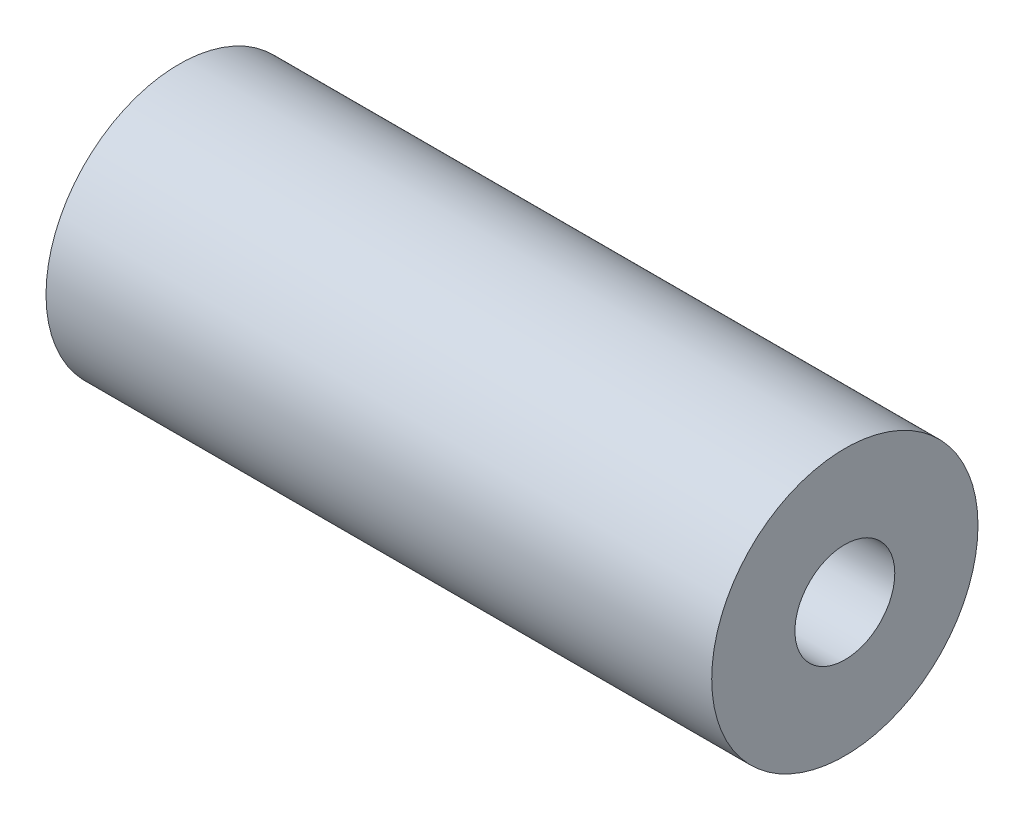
ISO-10303-21;
HEADER;
FILE_DESCRIPTION(('STEP AP214'),'2;1');
FILE_NAME('part.step','',(''),(''),'','','');
FILE_SCHEMA(('AUTOMOTIVE_DESIGN { 1 0 10303 214 1 1 1 1 }'));
ENDSEC;
DATA;
#1=APPLICATION_CONTEXT('core data for automotive mechanical design processes');
#2=APPLICATION_PROTOCOL_DEFINITION('international standard','automotive_design',2000,#1);
#3=PRODUCT_CONTEXT('',#1,'mechanical');
#4=PRODUCT('Part','Part','',(#3));
#5=PRODUCT_RELATED_PRODUCT_CATEGORY('part','',(#4));
#6=PRODUCT_DEFINITION_FORMATION('','',#4);
#7=PRODUCT_DEFINITION_CONTEXT('part definition',#1,'design');
#8=PRODUCT_DEFINITION('design','',#6,#7);
#9=PRODUCT_DEFINITION_SHAPE('','',#8);
#10=(LENGTH_UNIT() NAMED_UNIT(*) SI_UNIT(.MILLI.,.METRE.));
#11=(NAMED_UNIT(*) PLANE_ANGLE_UNIT() SI_UNIT($,.RADIAN.));
#12=(NAMED_UNIT(*) SI_UNIT($,.STERADIAN.) SOLID_ANGLE_UNIT());
#13=UNCERTAINTY_MEASURE_WITH_UNIT(LENGTH_MEASURE(1.E-05),#10,'distance_accuracy_value','');
#14=(GEOMETRIC_REPRESENTATION_CONTEXT(3) GLOBAL_UNCERTAINTY_ASSIGNED_CONTEXT((#13)) GLOBAL_UNIT_ASSIGNED_CONTEXT((#10,
#11,#12)) REPRESENTATION_CONTEXT('',''));
#15=CARTESIAN_POINT('',(0.,0.,0.));
#16=DIRECTION('',(0.,0.,1.));
#17=DIRECTION('',(1.,0.,0.));
#18=AXIS2_PLACEMENT_3D('',#15,#16,#17);
#19=CARTESIAN_POINT('',(63.5,0.,0.));
#20=DIRECTION('',(1.,0.,0.));
#21=DIRECTION('',(0.,0.,-1.));
#22=AXIS2_PLACEMENT_3D('',#19,#20,#21);
#23=PLANE('',#22);
#24=CARTESIAN_POINT('',(63.5,0.,0.));
#25=DIRECTION('',(1.,0.,0.));
#26=DIRECTION('',(0.,0.,-1.));
#27=AXIS2_PLACEMENT_3D('',#24,#25,#26);
#28=CIRCLE('',#27,12.7);
#29=CARTESIAN_POINT('',(63.5,0.,-12.7));
#30=VERTEX_POINT('',#29);
#31=EDGE_CURVE('E10',#30,#30,#28,.T.);
#32=ORIENTED_EDGE('',*,*,#31,.T.);
#33=EDGE_LOOP('',(#32));
#34=FACE_BOUND('',#33,.T.);
#35=CARTESIAN_POINT('',(63.5,0.,0.));
#36=DIRECTION('',(1.,0.,0.));
#37=DIRECTION('',(0.,0.,-1.));
#38=AXIS2_PLACEMENT_3D('',#35,#36,#37);
#39=CIRCLE('',#38,4.7625);
#40=CARTESIAN_POINT('',(63.5,0.,-4.7625));
#41=VERTEX_POINT('',#40);
#42=EDGE_CURVE('E40',#41,#41,#39,.T.);
#43=ORIENTED_EDGE('',*,*,#42,.F.);
#44=EDGE_LOOP('',(#43));
#45=FACE_BOUND('',#44,.T.);
#46=ADVANCED_FACE('F29',(#34,#45),#23,.T.);
#47=CARTESIAN_POINT('',(0.,0.,0.));
#48=DIRECTION('',(1.,0.,0.));
#49=DIRECTION('',(0.,0.,-1.));
#50=AXIS2_PLACEMENT_3D('',#47,#48,#49);
#51=PLANE('',#50);
#52=CARTESIAN_POINT('',(0.,0.,0.));
#53=DIRECTION('',(1.,0.,0.));
#54=DIRECTION('',(0.,0.,-1.));
#55=AXIS2_PLACEMENT_3D('',#52,#53,#54);
#56=CIRCLE('',#55,12.7);
#57=CARTESIAN_POINT('',(0.,0.,-12.7));
#58=VERTEX_POINT('',#57);
#59=EDGE_CURVE('E36',#58,#58,#56,.T.);
#60=ORIENTED_EDGE('',*,*,#59,.F.);
#61=EDGE_LOOP('',(#60));
#62=FACE_BOUND('',#61,.T.);
#63=CARTESIAN_POINT('',(0.,0.,0.));
#64=DIRECTION('',(1.,0.,0.));
#65=DIRECTION('',(0.,0.,-1.));
#66=AXIS2_PLACEMENT_3D('',#63,#64,#65);
#67=CIRCLE('',#66,4.7625);
#68=CARTESIAN_POINT('',(0.,0.,-4.7625));
#69=VERTEX_POINT('',#68);
#70=EDGE_CURVE('E44',#69,#69,#67,.T.);
#71=ORIENTED_EDGE('',*,*,#70,.T.);
#72=EDGE_LOOP('',(#71));
#73=FACE_BOUND('',#72,.T.);
#74=ADVANCED_FACE('F50',(#62,#73),#51,.F.);
#75=CARTESIAN_POINT('',(63.5,0.,0.));
#76=DIRECTION('',(-1.,0.,0.));
#77=DIRECTION('',(0.,0.,1.));
#78=AXIS2_PLACEMENT_3D('',#75,#76,#77);
#79=CYLINDRICAL_SURFACE('',#78,12.7);
#80=ORIENTED_EDGE('',*,*,#31,.F.);
#81=EDGE_LOOP('',(#80));
#82=FACE_BOUND('',#81,.T.);
#83=ORIENTED_EDGE('',*,*,#59,.T.);
#84=EDGE_LOOP('',(#83));
#85=FACE_BOUND('',#84,.T.);
#86=ADVANCED_FACE('F31',(#82,#85),#79,.T.);
#87=CARTESIAN_POINT('',(63.5,0.,0.));
#88=DIRECTION('',(-1.,0.,0.));
#89=DIRECTION('',(0.,0.,1.));
#90=AXIS2_PLACEMENT_3D('',#87,#88,#89);
#91=CYLINDRICAL_SURFACE('',#90,4.7625);
#92=ORIENTED_EDGE('',*,*,#42,.T.);
#93=EDGE_LOOP('',(#92));
#94=FACE_BOUND('',#93,.T.);
#95=ORIENTED_EDGE('',*,*,#70,.F.);
#96=EDGE_LOOP('',(#95));
#97=FACE_BOUND('',#96,.T.);
#98=ADVANCED_FACE('F52',(#94,#97),#91,.F.);
#99=CLOSED_SHELL('',(#46,#74,#86,#98));
#100=MANIFOLD_SOLID_BREP('B2',#99);
#101=ADVANCED_BREP_SHAPE_REPRESENTATION('',(#18,#100),#14);
#102=SHAPE_DEFINITION_REPRESENTATION(#9,#101);
ENDSEC;
END-ISO-10303-21;
